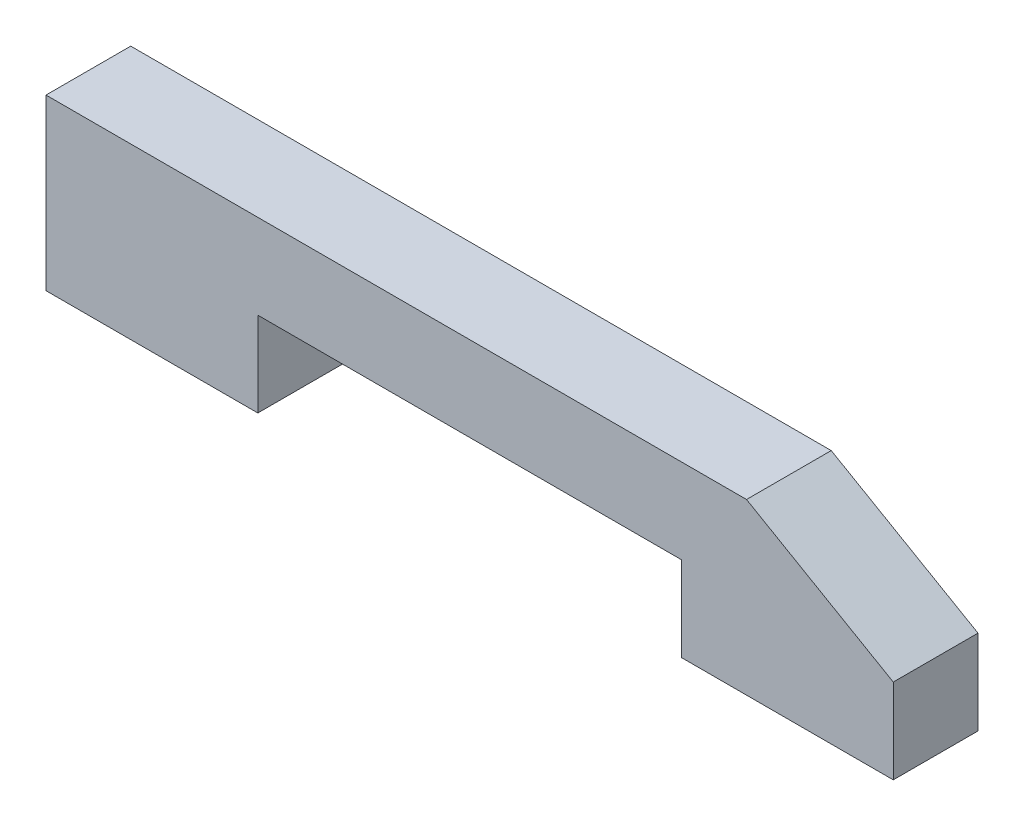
ISO-10303-21;
HEADER;
FILE_DESCRIPTION(('STEP AP214'),'2;1');
FILE_NAME('part.step','',(''),(''),'','','');
FILE_SCHEMA(('AUTOMOTIVE_DESIGN { 1 0 10303 214 1 1 1 1 }'));
ENDSEC;
DATA;
#1=APPLICATION_CONTEXT('core data for automotive mechanical design processes');
#2=APPLICATION_PROTOCOL_DEFINITION('international standard','automotive_design',2000,#1);
#3=PRODUCT_CONTEXT('',#1,'mechanical');
#4=PRODUCT('Part','Part','',(#3));
#5=PRODUCT_RELATED_PRODUCT_CATEGORY('part','',(#4));
#6=PRODUCT_DEFINITION_FORMATION('','',#4);
#7=PRODUCT_DEFINITION_CONTEXT('part definition',#1,'design');
#8=PRODUCT_DEFINITION('design','',#6,#7);
#9=PRODUCT_DEFINITION_SHAPE('','',#8);
#10=(LENGTH_UNIT() NAMED_UNIT(*) SI_UNIT(.MILLI.,.METRE.));
#11=(NAMED_UNIT(*) PLANE_ANGLE_UNIT() SI_UNIT($,.RADIAN.));
#12=(NAMED_UNIT(*) SI_UNIT($,.STERADIAN.) SOLID_ANGLE_UNIT());
#13=UNCERTAINTY_MEASURE_WITH_UNIT(LENGTH_MEASURE(1.E-05),#10,'distance_accuracy_value','');
#14=(GEOMETRIC_REPRESENTATION_CONTEXT(3) GLOBAL_UNCERTAINTY_ASSIGNED_CONTEXT((#13)) GLOBAL_UNIT_ASSIGNED_CONTEXT((#10,
#11,#12)) REPRESENTATION_CONTEXT('',''));
#15=CARTESIAN_POINT('',(0.,0.,0.));
#16=DIRECTION('',(0.,0.,1.));
#17=DIRECTION('',(1.,0.,0.));
#18=AXIS2_PLACEMENT_3D('',#15,#16,#17);
#19=CARTESIAN_POINT('',(7.5,0.,3.));
#20=DIRECTION('',(0.,1.,0.));
#21=DIRECTION('',(-1.,0.,0.));
#22=AXIS2_PLACEMENT_3D('',#19,#20,#21);
#23=PLANE('',#22);
#24=DIRECTION('',(1.,0.,0.));
#25=VECTOR('',#24,1.);
#26=CARTESIAN_POINT('',(7.5,0.,0.));
#27=LINE('',#26,#25);
#28=CARTESIAN_POINT('',(0.,0.,0.));
#29=VERTEX_POINT('',#28);
#30=CARTESIAN_POINT('',(7.5,0.,0.));
#31=VERTEX_POINT('',#30);
#32=EDGE_CURVE('E134',#29,#31,#27,.T.);
#33=ORIENTED_EDGE('',*,*,#32,.T.);
#34=DIRECTION('',(0.,0.,-1.));
#35=VECTOR('',#34,1.);
#36=CARTESIAN_POINT('',(7.5,0.,3.));
#37=LINE('',#36,#35);
#38=CARTESIAN_POINT('',(7.5,0.,3.));
#39=VERTEX_POINT('',#38);
#40=EDGE_CURVE('E115',#39,#31,#37,.T.);
#41=ORIENTED_EDGE('',*,*,#40,.F.);
#42=DIRECTION('',(1.,0.,0.));
#43=VECTOR('',#42,1.);
#44=CARTESIAN_POINT('',(7.5,0.,3.));
#45=LINE('',#44,#43);
#46=CARTESIAN_POINT('',(0.,0.,3.));
#47=VERTEX_POINT('',#46);
#48=EDGE_CURVE('E122',#47,#39,#45,.T.);
#49=ORIENTED_EDGE('',*,*,#48,.F.);
#50=DIRECTION('',(0.,0.,-1.));
#51=VECTOR('',#50,1.);
#52=CARTESIAN_POINT('',(0.,0.,3.));
#53=LINE('',#52,#51);
#54=EDGE_CURVE('E154',#47,#29,#53,.T.);
#55=ORIENTED_EDGE('',*,*,#54,.T.);
#56=EDGE_LOOP('',(#33,#41,#49,#55));
#57=FACE_BOUND('',#56,.T.);
#58=ADVANCED_FACE('F39',(#57),#23,.F.);
#59=CARTESIAN_POINT('',(7.5,3.,3.));
#60=DIRECTION('',(-1.,0.,0.));
#61=DIRECTION('',(0.,0.,1.));
#62=AXIS2_PLACEMENT_3D('',#59,#60,#61);
#63=PLANE('',#62);
#64=DIRECTION('',(0.,1.,0.));
#65=VECTOR('',#64,1.);
#66=CARTESIAN_POINT('',(7.5,3.,0.));
#67=LINE('',#66,#65);
#68=CARTESIAN_POINT('',(7.5,3.,0.));
#69=VERTEX_POINT('',#68);
#70=EDGE_CURVE('E167',#31,#69,#67,.T.);
#71=ORIENTED_EDGE('',*,*,#70,.T.);
#72=DIRECTION('',(0.,0.,-1.));
#73=VECTOR('',#72,1.);
#74=CARTESIAN_POINT('',(7.5,3.,3.));
#75=LINE('',#74,#73);
#76=CARTESIAN_POINT('',(7.5,3.,3.));
#77=VERTEX_POINT('',#76);
#78=EDGE_CURVE('E118',#77,#69,#75,.T.);
#79=ORIENTED_EDGE('',*,*,#78,.F.);
#80=DIRECTION('',(0.,1.,0.));
#81=VECTOR('',#80,1.);
#82=CARTESIAN_POINT('',(7.5,3.,3.));
#83=LINE('',#82,#81);
#84=EDGE_CURVE('E111',#39,#77,#83,.T.);
#85=ORIENTED_EDGE('',*,*,#84,.F.);
#86=ORIENTED_EDGE('',*,*,#40,.T.);
#87=EDGE_LOOP('',(#71,#79,#85,#86));
#88=FACE_BOUND('',#87,.T.);
#89=ADVANCED_FACE('F113',(#88),#63,.F.);
#90=CARTESIAN_POINT('',(22.5,3.,3.));
#91=DIRECTION('',(0.,1.,0.));
#92=DIRECTION('',(0.,0.,1.));
#93=AXIS2_PLACEMENT_3D('',#90,#91,#92);
#94=PLANE('',#93);
#95=DIRECTION('',(1.,0.,0.));
#96=VECTOR('',#95,1.);
#97=CARTESIAN_POINT('',(22.5,3.,0.));
#98=LINE('',#97,#96);
#99=CARTESIAN_POINT('',(22.5,3.,0.));
#100=VERTEX_POINT('',#99);
#101=EDGE_CURVE('E165',#69,#100,#98,.T.);
#102=ORIENTED_EDGE('',*,*,#101,.T.);
#103=DIRECTION('',(0.,0.,-1.));
#104=VECTOR('',#103,1.);
#105=CARTESIAN_POINT('',(22.5,3.,3.));
#106=LINE('',#105,#104);
#107=CARTESIAN_POINT('',(22.5,3.,3.));
#108=VERTEX_POINT('',#107);
#109=EDGE_CURVE('E139',#108,#100,#106,.T.);
#110=ORIENTED_EDGE('',*,*,#109,.F.);
#111=DIRECTION('',(1.,0.,0.));
#112=VECTOR('',#111,1.);
#113=CARTESIAN_POINT('',(22.5,3.,3.));
#114=LINE('',#113,#112);
#115=EDGE_CURVE('E121',#77,#108,#114,.T.);
#116=ORIENTED_EDGE('',*,*,#115,.F.);
#117=ORIENTED_EDGE('',*,*,#78,.T.);
#118=EDGE_LOOP('',(#102,#110,#116,#117));
#119=FACE_BOUND('',#118,.T.);
#120=ADVANCED_FACE('F183',(#119),#94,.F.);
#121=CARTESIAN_POINT('',(22.5,0.,3.));
#122=DIRECTION('',(1.,0.,0.));
#123=DIRECTION('',(0.,0.,-1.));
#124=AXIS2_PLACEMENT_3D('',#121,#122,#123);
#125=PLANE('',#124);
#126=DIRECTION('',(0.,-1.,0.));
#127=VECTOR('',#126,1.);
#128=CARTESIAN_POINT('',(22.5,0.,0.));
#129=LINE('',#128,#127);
#130=CARTESIAN_POINT('',(22.5,0.,0.));
#131=VERTEX_POINT('',#130);
#132=EDGE_CURVE('E163',#100,#131,#129,.T.);
#133=ORIENTED_EDGE('',*,*,#132,.T.);
#134=DIRECTION('',(0.,0.,-1.));
#135=VECTOR('',#134,1.);
#136=CARTESIAN_POINT('',(22.5,0.,3.));
#137=LINE('',#136,#135);
#138=CARTESIAN_POINT('',(22.5,0.,3.));
#139=VERTEX_POINT('',#138);
#140=EDGE_CURVE('E145',#139,#131,#137,.T.);
#141=ORIENTED_EDGE('',*,*,#140,.F.);
#142=DIRECTION('',(0.,-1.,0.));
#143=VECTOR('',#142,1.);
#144=CARTESIAN_POINT('',(22.5,0.,3.));
#145=LINE('',#144,#143);
#146=EDGE_CURVE('E177',#108,#139,#145,.T.);
#147=ORIENTED_EDGE('',*,*,#146,.F.);
#148=ORIENTED_EDGE('',*,*,#109,.T.);
#149=EDGE_LOOP('',(#133,#141,#147,#148));
#150=FACE_BOUND('',#149,.T.);
#151=ADVANCED_FACE('F187',(#150),#125,.F.);
#152=CARTESIAN_POINT('',(30.,0.,3.));
#153=DIRECTION('',(0.,1.,0.));
#154=DIRECTION('',(-1.,0.,0.));
#155=AXIS2_PLACEMENT_3D('',#152,#153,#154);
#156=PLANE('',#155);
#157=DIRECTION('',(1.,0.,0.));
#158=VECTOR('',#157,1.);
#159=CARTESIAN_POINT('',(30.,0.,0.));
#160=LINE('',#159,#158);
#161=CARTESIAN_POINT('',(30.,0.,0.));
#162=VERTEX_POINT('',#161);
#163=EDGE_CURVE('E161',#131,#162,#160,.T.);
#164=ORIENTED_EDGE('',*,*,#163,.T.);
#165=DIRECTION('',(0.,0.,-1.));
#166=VECTOR('',#165,1.);
#167=CARTESIAN_POINT('',(30.,0.,3.));
#168=LINE('',#167,#166);
#169=CARTESIAN_POINT('',(30.,0.,3.));
#170=VERTEX_POINT('',#169);
#171=EDGE_CURVE('E148',#170,#162,#168,.T.);
#172=ORIENTED_EDGE('',*,*,#171,.F.);
#173=DIRECTION('',(1.,0.,0.));
#174=VECTOR('',#173,1.);
#175=CARTESIAN_POINT('',(30.,0.,3.));
#176=LINE('',#175,#174);
#177=EDGE_CURVE('E175',#139,#170,#176,.T.);
#178=ORIENTED_EDGE('',*,*,#177,.F.);
#179=ORIENTED_EDGE('',*,*,#140,.T.);
#180=EDGE_LOOP('',(#164,#172,#178,#179));
#181=FACE_BOUND('',#180,.T.);
#182=ADVANCED_FACE('F192',(#181),#156,.F.);
#183=CARTESIAN_POINT('',(30.,6.,3.));
#184=DIRECTION('',(-1.,0.,0.));
#185=DIRECTION('',(0.,0.,1.));
#186=AXIS2_PLACEMENT_3D('',#183,#184,#185);
#187=PLANE('',#186);
#188=DIRECTION('',(0.,1.,0.));
#189=VECTOR('',#188,1.);
#190=CARTESIAN_POINT('',(30.,6.,0.));
#191=LINE('',#190,#189);
#192=CARTESIAN_POINT('',(30.,2.99999999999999,0.));
#193=VERTEX_POINT('',#192);
#194=EDGE_CURVE('E159',#162,#193,#191,.T.);
#195=ORIENTED_EDGE('',*,*,#194,.T.);
#196=DIRECTION('',(0.,0.,1.));
#197=VECTOR('',#196,1.);
#198=CARTESIAN_POINT('',(30.,2.99999999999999,3.));
#199=LINE('',#198,#197);
#200=CARTESIAN_POINT('',(30.,2.99999999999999,3.));
#201=VERTEX_POINT('',#200);
#202=EDGE_CURVE('E48',#193,#201,#199,.T.);
#203=ORIENTED_EDGE('',*,*,#202,.T.);
#204=DIRECTION('',(0.,1.,0.));
#205=VECTOR('',#204,1.);
#206=CARTESIAN_POINT('',(30.,6.,3.));
#207=LINE('',#206,#205);
#208=EDGE_CURVE('E173',#170,#201,#207,.T.);
#209=ORIENTED_EDGE('',*,*,#208,.F.);
#210=ORIENTED_EDGE('',*,*,#171,.T.);
#211=EDGE_LOOP('',(#195,#203,#209,#210));
#212=FACE_BOUND('',#211,.T.);
#213=ADVANCED_FACE('F211',(#212),#187,.F.);
#214=CARTESIAN_POINT('',(0.,6.,3.));
#215=DIRECTION('',(0.,-1.,0.));
#216=DIRECTION('',(1.,0.,0.));
#217=AXIS2_PLACEMENT_3D('',#214,#215,#216);
#218=PLANE('',#217);
#219=DIRECTION('',(-1.,0.,0.));
#220=VECTOR('',#219,1.);
#221=CARTESIAN_POINT('',(0.,6.,3.));
#222=LINE('',#221,#220);
#223=CARTESIAN_POINT('',(24.8038475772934,6.,3.));
#224=VERTEX_POINT('',#223);
#225=CARTESIAN_POINT('',(0.,6.,3.));
#226=VERTEX_POINT('',#225);
#227=EDGE_CURVE('E171',#224,#226,#222,.T.);
#228=ORIENTED_EDGE('',*,*,#227,.F.);
#229=DIRECTION('',(0.,0.,-1.));
#230=VECTOR('',#229,1.);
#231=CARTESIAN_POINT('',(24.8038475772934,6.,3.));
#232=LINE('',#231,#230);
#233=CARTESIAN_POINT('',(24.8038475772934,6.,0.));
#234=VERTEX_POINT('',#233);
#235=EDGE_CURVE('E135',#224,#234,#232,.T.);
#236=ORIENTED_EDGE('',*,*,#235,.T.);
#237=DIRECTION('',(-1.,0.,0.));
#238=VECTOR('',#237,1.);
#239=CARTESIAN_POINT('',(0.,6.,0.));
#240=LINE('',#239,#238);
#241=CARTESIAN_POINT('',(0.,6.,0.));
#242=VERTEX_POINT('',#241);
#243=EDGE_CURVE('E157',#234,#242,#240,.T.);
#244=ORIENTED_EDGE('',*,*,#243,.T.);
#245=DIRECTION('',(0.,0.,-1.));
#246=VECTOR('',#245,1.);
#247=CARTESIAN_POINT('',(0.,6.,3.));
#248=LINE('',#247,#246);
#249=EDGE_CURVE('E151',#226,#242,#248,.T.);
#250=ORIENTED_EDGE('',*,*,#249,.F.);
#251=EDGE_LOOP('',(#228,#236,#244,#250));
#252=FACE_BOUND('',#251,.T.);
#253=ADVANCED_FACE('F198',(#252),#218,.F.);
#254=CARTESIAN_POINT('',(0.,0.,3.));
#255=DIRECTION('',(1.,0.,0.));
#256=DIRECTION('',(0.,0.,-1.));
#257=AXIS2_PLACEMENT_3D('',#254,#255,#256);
#258=PLANE('',#257);
#259=DIRECTION('',(0.,-1.,0.));
#260=VECTOR('',#259,1.);
#261=CARTESIAN_POINT('',(0.,0.,0.));
#262=LINE('',#261,#260);
#263=EDGE_CURVE('E131',#242,#29,#262,.T.);
#264=ORIENTED_EDGE('',*,*,#263,.T.);
#265=ORIENTED_EDGE('',*,*,#54,.F.);
#266=DIRECTION('',(0.,-1.,0.));
#267=VECTOR('',#266,1.);
#268=CARTESIAN_POINT('',(0.,0.,3.));
#269=LINE('',#268,#267);
#270=EDGE_CURVE('E127',#226,#47,#269,.T.);
#271=ORIENTED_EDGE('',*,*,#270,.F.);
#272=ORIENTED_EDGE('',*,*,#249,.T.);
#273=EDGE_LOOP('',(#264,#265,#271,#272));
#274=FACE_BOUND('',#273,.T.);
#275=ADVANCED_FACE('F203',(#274),#258,.F.);
#276=CARTESIAN_POINT('',(0.,0.,3.));
#277=DIRECTION('',(0.,0.,-1.));
#278=DIRECTION('',(-1.,0.,0.));
#279=AXIS2_PLACEMENT_3D('',#276,#277,#278);
#280=PLANE('',#279);
#281=ORIENTED_EDGE('',*,*,#208,.T.);
#282=DIRECTION('',(0.866025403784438,-0.500000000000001,0.));
#283=VECTOR('',#282,1.);
#284=CARTESIAN_POINT('',(24.8038475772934,6.,3.));
#285=LINE('',#284,#283);
#286=EDGE_CURVE('E11',#201,#224,#285,.F.);
#287=ORIENTED_EDGE('',*,*,#286,.T.);
#288=ORIENTED_EDGE('',*,*,#227,.T.);
#289=ORIENTED_EDGE('',*,*,#270,.T.);
#290=ORIENTED_EDGE('',*,*,#48,.T.);
#291=ORIENTED_EDGE('',*,*,#84,.T.);
#292=ORIENTED_EDGE('',*,*,#115,.T.);
#293=ORIENTED_EDGE('',*,*,#146,.T.);
#294=ORIENTED_EDGE('',*,*,#177,.T.);
#295=EDGE_LOOP('',(#281,#287,#288,#289,#290,#291,#292,#293,#294));
#296=FACE_BOUND('',#295,.T.);
#297=ADVANCED_FACE('F125',(#296),#280,.F.);
#298=CARTESIAN_POINT('',(0.,0.,0.));
#299=DIRECTION('',(0.,0.,-1.));
#300=DIRECTION('',(-1.,0.,0.));
#301=AXIS2_PLACEMENT_3D('',#298,#299,#300);
#302=PLANE('',#301);
#303=ORIENTED_EDGE('',*,*,#243,.F.);
#304=DIRECTION('',(-0.866025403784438,0.500000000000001,0.));
#305=VECTOR('',#304,1.);
#306=CARTESIAN_POINT('',(8.79903810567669,15.2403810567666,0.));
#307=LINE('',#306,#305);
#308=EDGE_CURVE('E62',#234,#193,#307,.F.);
#309=ORIENTED_EDGE('',*,*,#308,.T.);
#310=ORIENTED_EDGE('',*,*,#194,.F.);
#311=ORIENTED_EDGE('',*,*,#163,.F.);
#312=ORIENTED_EDGE('',*,*,#132,.F.);
#313=ORIENTED_EDGE('',*,*,#101,.F.);
#314=ORIENTED_EDGE('',*,*,#70,.F.);
#315=ORIENTED_EDGE('',*,*,#32,.F.);
#316=ORIENTED_EDGE('',*,*,#263,.F.);
#317=EDGE_LOOP('',(#303,#309,#310,#311,#312,#313,#314,#315,#316));
#318=FACE_BOUND('',#317,.T.);
#319=ADVANCED_FACE('F201',(#318),#302,.T.);
#320=CARTESIAN_POINT('',(24.8038475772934,6.,3.));
#321=DIRECTION('',(-0.500000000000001,-0.866025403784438,0.));
#322=DIRECTION('',(0.,0.,-1.));
#323=AXIS2_PLACEMENT_3D('',#320,#321,#322);
#324=PLANE('',#323);
#325=ORIENTED_EDGE('',*,*,#286,.F.);
#326=ORIENTED_EDGE('',*,*,#202,.F.);
#327=ORIENTED_EDGE('',*,*,#308,.F.);
#328=ORIENTED_EDGE('',*,*,#235,.F.);
#329=EDGE_LOOP('',(#325,#326,#327,#328));
#330=FACE_BOUND('',#329,.T.);
#331=ADVANCED_FACE('F42',(#330),#324,.F.);
#332=CLOSED_SHELL('',(#58,#89,#120,#151,#182,#213,#253,#275,#297,#319,#331));
#333=MANIFOLD_SOLID_BREP('B2',#332);
#334=ADVANCED_BREP_SHAPE_REPRESENTATION('',(#18,#333),#14);
#335=SHAPE_DEFINITION_REPRESENTATION(#9,#334);
ENDSEC;
END-ISO-10303-21;
